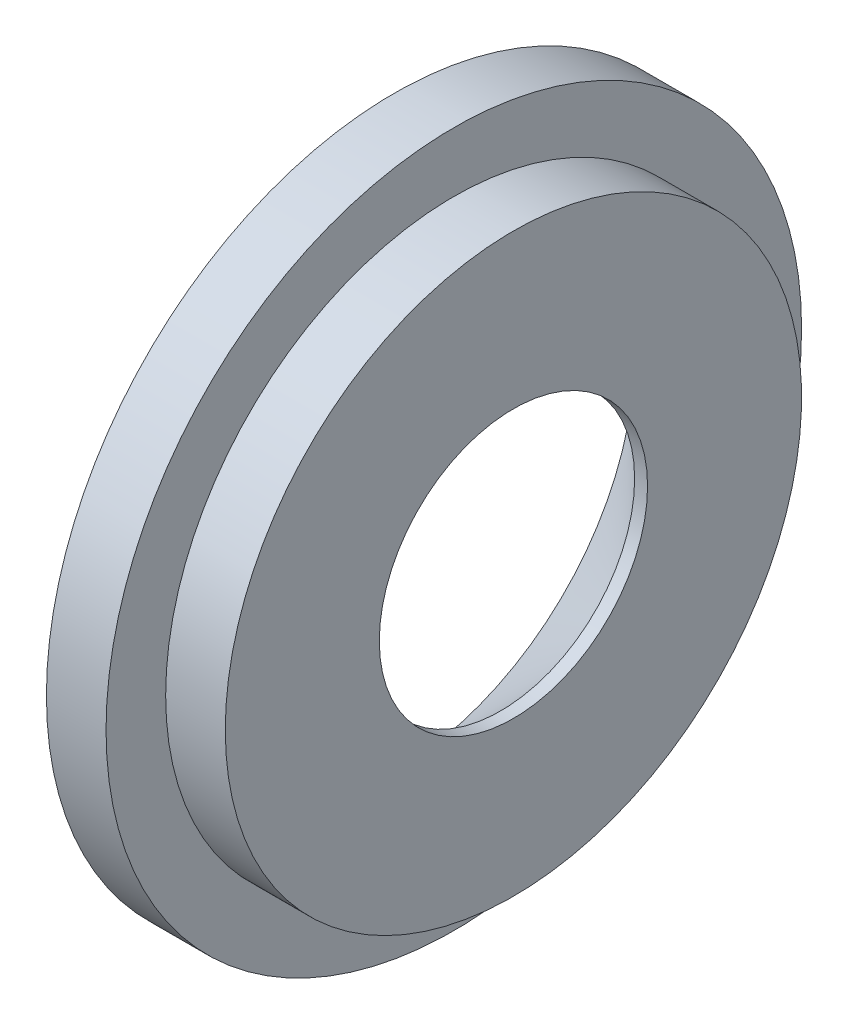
from build123d import *


with BuildPart() as part:
    # Esquisse1 → Base-R_volution (revolve)
    with BuildSketch(Plane.XY, mode=Mode.PRIVATE) as base_r_volution_sk:
        Polygon((0, 17.5), (0, 12.1), (5.35, 6.75), (6, 6.75), (6, 14.5), (3, 14.5), (3, 17.5), align=None)
    revolve(base_r_volution_sk.sketch.rotate(Axis((0, 0, 0), (1, 0, 0)), 90), axis=Axis((0, 0, 0), (1, 0, 0)))


solid = part.part
